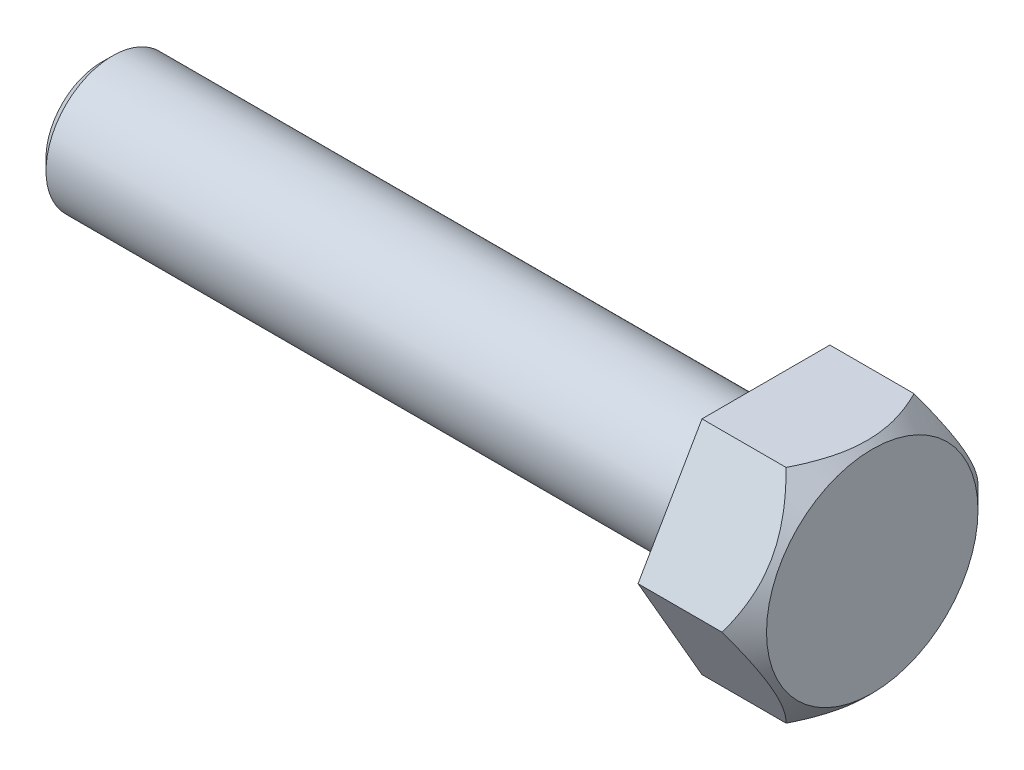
from build123d import *

# Parameters (mm, degrees)
ESQUISSE4_R              = 3
BASE_EXTRUSION_DEPTH     = 30
BOSSAGE_EXTRUSION1_DEPTH = 4.8
CHANFREIN1_SIZE          = 0.5


with BuildPart() as part:
    # Esquisse4 → Base-Extrusion (new body)
    with BuildSketch(Plane(origin=(0, 0, 0), x_dir=(0, 0, -1), z_dir=(1, 0, 0))):
        Circle(ESQUISSE4_R)
    extrude(amount=-BASE_EXTRUSION_DEPTH)

    # Esquisse7 → Bossage-Extrusion1 (add)
    with BuildSketch(Plane(origin=(0, 0, 0), x_dir=(0, 0, -1), z_dir=(1, 0, 0))):
        Polygon((-2.886751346, 5), (2.886751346, 5), (5.773502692, 0), (2.886751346, -5), (-2.886751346, -5), (-5.773502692, 0), align=None)
    extrude(amount=BOSSAGE_EXTRUSION1_DEPTH)

    # Chanfrein1
    chanfrein1_edges = [part.edges().sort_by_distance(p)[0] for p in [
        (-30, 0, 3),
    ]]
    chamfer(chanfrein1_edges, length=CHANFREIN1_SIZE)

    # Couper-Balayage2: sweep along a path in Esquisse13
    with BuildLine(Plane(origin=(4.8, 0, 0), x_dir=(0, 0, -1), z_dir=(1, 0, 0))) as couper_balayage2_path:
        CenterArc((0, 0), 5, 0, 360)
    # Esquisse12 → Couper-Balayage2 (sweep, cut)
    with BuildSketch(Plane(origin=(0, 0, 0), x_dir=(1, 0, 0), z_dir=(0, 1, 0))):
        Polygon((4.8, 5.773502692), (3.8, 5.773502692), (4.8, 4.773502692), align=None)
    sweep(path=couper_balayage2_path.line, mode=Mode.SUBTRACT)


solid = part.part
